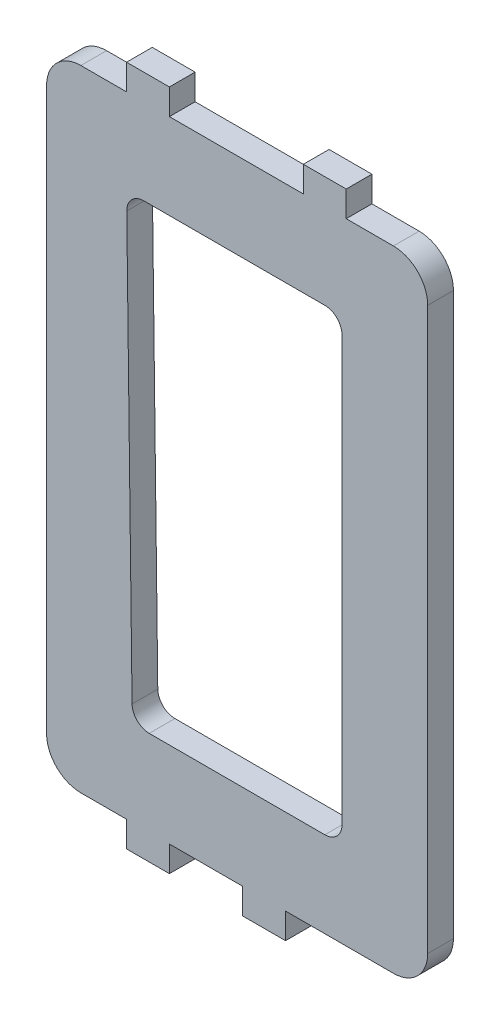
from build123d import *

# Parameters (mm, degrees)
SALIENTE_EXTRUIR1_DEPTH = 3


with BuildPart() as part:
    # Croquis1 → Saliente-Extruir1 (new body)
    with BuildSketch(Plane.XY):
        with BuildLine():
            Line((-27.735211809, 52.645866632), (-43.365211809, 52.645866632))
            Line((-43.365211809, 52.645866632), (-43.365211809, 55.645866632))
            Line((-43.365211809, 55.645866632), (-48.365211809, 55.645866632))
            Line((-48.365211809, 55.645866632), (-48.365211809, 52.645866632))
            Line((-48.365211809, 52.645866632), (-53.695211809, 52.645866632))
            ThreePointArc((-53.695211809, 52.645866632), (-56.523638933, 51.474293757), (-57.695211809, 48.645866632))
            Line((-57.695211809, 48.645866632), (-57.695211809, -16.854133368))
            ThreePointArc((-57.695211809, -16.854133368), (-56.523638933, -19.682560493), (-53.695211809, -20.854133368))
            Line((-53.695211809, -20.854133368), (-48.365211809, -20.854133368))
            Line((-48.365211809, -20.854133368), (-48.365211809, -23.854133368))
            Line((-48.365211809, -23.854133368), (-43.365211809, -23.854133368))
            Line((-43.365211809, -23.854133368), (-43.365211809, -20.854133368))
            Line((-43.365211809, -20.854133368), (-34.815211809, -20.854133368))
            Line((-34.815211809, -20.854133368), (-34.815211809, -23.854133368))
            Line((-34.815211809, -23.854133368), (-29.815211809, -23.854133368))
            Line((-29.815211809, -23.854133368), (-29.815211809, -20.854133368))
            Line((-29.815211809, -20.854133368), (-17.225211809, -20.854133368))
            ThreePointArc((-17.225211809, -20.854133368), (-14.396784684, -19.682560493), (-13.225211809, -16.854133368))
            Line((-13.225211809, -16.854133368), (-13.225211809, 48.645866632))
            ThreePointArc((-13.225211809, 48.645866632), (-14.396784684, 51.474293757), (-17.225211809, 52.645866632))
            Line((-17.225211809, 52.645866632), (-22.735211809, 52.645866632))
            Line((-22.735211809, 52.645866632), (-22.735211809, 55.645866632))
            Line((-22.735211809, 55.645866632), (-27.735211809, 55.645866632))
            Line((-27.735211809, 55.645866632), (-27.735211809, 52.645866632))
        make_face()
        with BuildLine():
            Line((-35.550211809, 42.645866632), (-25.225211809, 42.645866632))
            ThreePointArc((-25.225211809, 42.645866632), (-23.810998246, 42.060080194), (-23.225211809, 40.645866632))
            Line((-23.225211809, 40.645866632), (-23.225211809, -8.854133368))
            ThreePointArc((-23.225211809, -8.854133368), (-23.810998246, -10.26834693), (-25.225211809, -10.854133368))
            Line((-25.225211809, -10.854133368), (-45.720101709, -10.854133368))
            ThreePointArc((-45.720101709, -10.854133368), (-47.125432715, -10.277174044), (-47.719944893, -8.879178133))
            Line((-47.719944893, -8.879178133), (-48.339851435, 40.620821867))
            ThreePointArc((-48.339851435, 40.620821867), (-47.763048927, 42.051197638), (-46.340008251, 42.645866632))
            Line((-46.340008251, 42.645866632), (-35.550211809, 42.645866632))
        make_face(mode=Mode.SUBTRACT)
    extrude(amount=SALIENTE_EXTRUIR1_DEPTH)


solid = part.part
